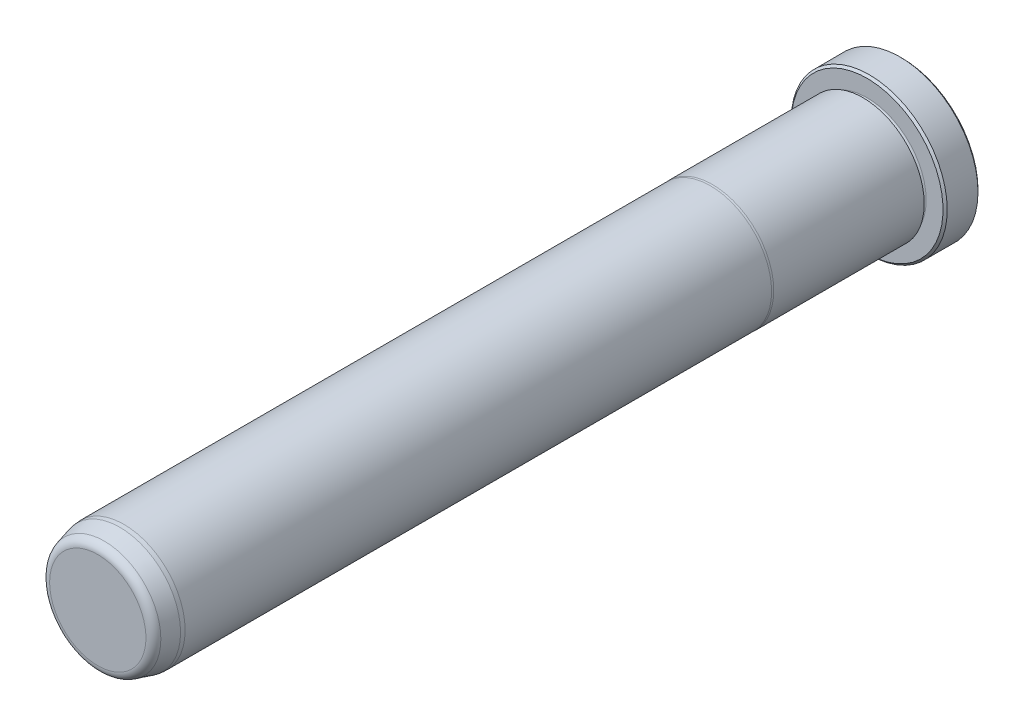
from build123d import *

# Parameters (mm, degrees)
FILLET6_R     = 1.5875
CHAMFER1_SIZE = 0.381


with BuildPart() as part:
    # Sketch1 → Revolve1 (revolve)
    with BuildSketch(Plane(origin=(0, 0, 0), x_dir=(0, 0, -1), z_dir=(1, 0, 0)), mode=Mode.PRIVATE) as revolve1_sk:
        with BuildLine():
            Line((0, 0), (0, 14.1605))
            Line((0, 14.1605), (-6.35, 14.1605))
            Line((-6.35, 14.1605), (-6.35, 10.7188))
            ThreePointArc((-6.35, 10.7188), (-6.731, 10.3378), (-7.112, 10.7188))
            Line((-7.112, 10.7188), (-7.112, 11.1252))
            Line((-7.112, 11.1252), (-34.434763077, 11.1252))
            Line((-34.434763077, 11.1252), (-34.798, 11.0998))
            Line((-34.798, 11.0998), (-141.2875, 11.0998))
            Line((-141.2875, 11.0998), (-142.0495, 11.033133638))
            Line((-142.0495, 11.033133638), (-146.05, 9.961202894))
            Line((-146.05, 9.961202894), (-146.05, 0))
            Line((-146.05, 0), (0, 0))
        make_face()
    revolve(revolve1_sk.sketch.rotate(Axis((0, 0, 0), (0, 0, -1)), 90), axis=Axis((0, 0, 0), (0, 0, -1)))

    # Fillet6
    fillet6_edges = [part.edges().sort_by_distance(p)[0] for p in [
        (-9.961202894, 0, 146.05),
    ]]
    fillet(fillet6_edges, radius=FILLET6_R)

    # Chamfer1
    chamfer1_edges = [part.edges().sort_by_distance(p)[0] for p in [
        (-14.1605, 0, 6.35),
        (-14.1605, 0, 0),
    ]]
    chamfer(chamfer1_edges, length=CHAMFER1_SIZE)


solid = part.part
